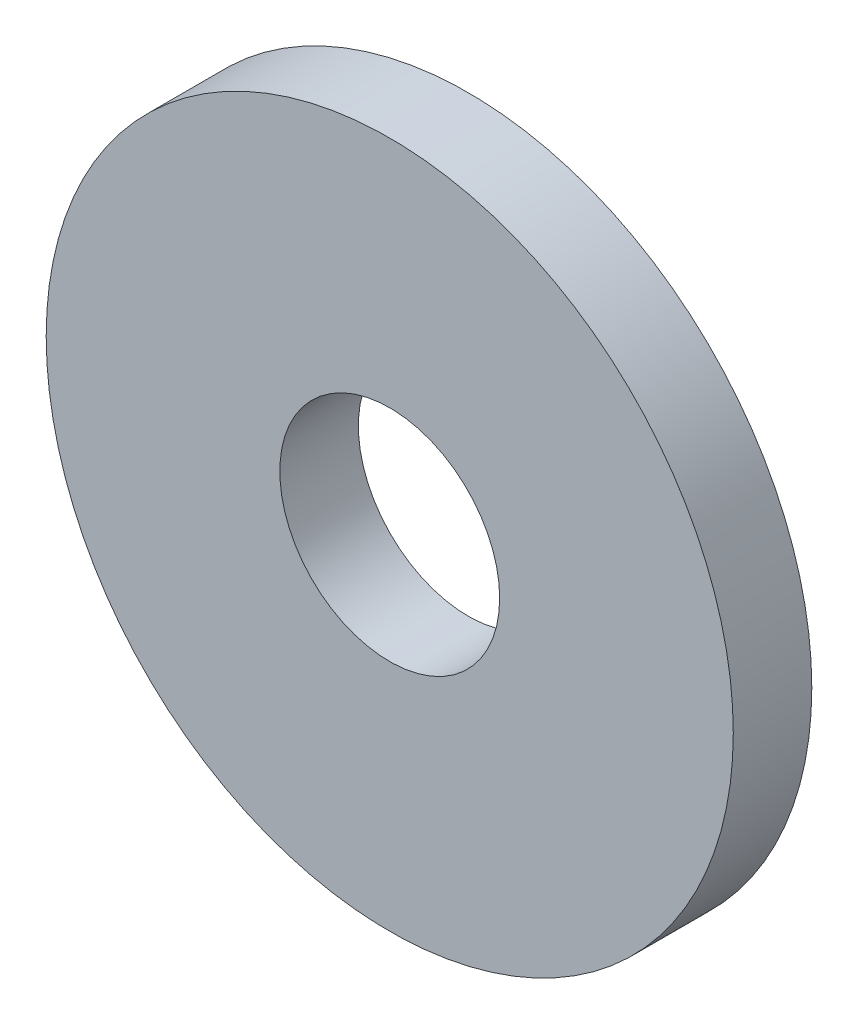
ISO-10303-21;
HEADER;
FILE_DESCRIPTION(('STEP AP214'),'2;1');
FILE_NAME('part.step','',(''),(''),'','','');
FILE_SCHEMA(('AUTOMOTIVE_DESIGN { 1 0 10303 214 1 1 1 1 }'));
ENDSEC;
DATA;
#1=APPLICATION_CONTEXT('core data for automotive mechanical design processes');
#2=APPLICATION_PROTOCOL_DEFINITION('international standard','automotive_design',2000,#1);
#3=PRODUCT_CONTEXT('',#1,'mechanical');
#4=PRODUCT('Part','Part','',(#3));
#5=PRODUCT_RELATED_PRODUCT_CATEGORY('part','',(#4));
#6=PRODUCT_DEFINITION_FORMATION('','',#4);
#7=PRODUCT_DEFINITION_CONTEXT('part definition',#1,'design');
#8=PRODUCT_DEFINITION('design','',#6,#7);
#9=PRODUCT_DEFINITION_SHAPE('','',#8);
#10=(LENGTH_UNIT() NAMED_UNIT(*) SI_UNIT(.MILLI.,.METRE.));
#11=(NAMED_UNIT(*) PLANE_ANGLE_UNIT() SI_UNIT($,.RADIAN.));
#12=(NAMED_UNIT(*) SI_UNIT($,.STERADIAN.) SOLID_ANGLE_UNIT());
#13=UNCERTAINTY_MEASURE_WITH_UNIT(LENGTH_MEASURE(1.E-05),#10,'distance_accuracy_value','');
#14=(GEOMETRIC_REPRESENTATION_CONTEXT(3) GLOBAL_UNCERTAINTY_ASSIGNED_CONTEXT((#13)) GLOBAL_UNIT_ASSIGNED_CONTEXT((#10,
#11,#12)) REPRESENTATION_CONTEXT('',''));
#15=CARTESIAN_POINT('',(0.,0.,0.));
#16=DIRECTION('',(0.,0.,1.));
#17=DIRECTION('',(1.,0.,0.));
#18=AXIS2_PLACEMENT_3D('',#15,#16,#17);
#19=CARTESIAN_POINT('',(0.,0.,2.));
#20=DIRECTION('',(0.,0.,-1.));
#21=DIRECTION('',(-1.,0.,0.));
#22=AXIS2_PLACEMENT_3D('',#19,#20,#21);
#23=PLANE('',#22);
#24=CARTESIAN_POINT('',(0.,0.,2.));
#25=DIRECTION('',(0.,0.,1.));
#26=DIRECTION('',(1.,0.,0.));
#27=AXIS2_PLACEMENT_3D('',#24,#25,#26);
#28=CIRCLE('',#27,2.8);
#29=CARTESIAN_POINT('',(2.8,0.,2.));
#30=VERTEX_POINT('',#29);
#31=EDGE_CURVE('E26',#30,#30,#28,.F.);
#32=ORIENTED_EDGE('',*,*,#31,.T.);
#33=EDGE_LOOP('',(#32));
#34=FACE_BOUND('',#33,.T.);
#35=CARTESIAN_POINT('',(0.,0.,2.));
#36=DIRECTION('',(0.,0.,1.));
#37=DIRECTION('',(1.,0.,0.));
#38=AXIS2_PLACEMENT_3D('',#35,#36,#37);
#39=CIRCLE('',#38,8.75);
#40=CARTESIAN_POINT('',(8.75,0.,2.));
#41=VERTEX_POINT('',#40);
#42=EDGE_CURVE('E17',#41,#41,#39,.F.);
#43=ORIENTED_EDGE('',*,*,#42,.F.);
#44=EDGE_LOOP('',(#43));
#45=FACE_BOUND('',#44,.T.);
#46=ADVANCED_FACE('F14',(#34,#45),#23,.F.);
#47=CARTESIAN_POINT('',(0.,0.,0.));
#48=DIRECTION('',(0.,0.,1.));
#49=DIRECTION('',(1.,0.,0.));
#50=AXIS2_PLACEMENT_3D('',#47,#48,#49);
#51=CYLINDRICAL_SURFACE('',#50,8.75);
#52=CARTESIAN_POINT('',(0.,0.,0.));
#53=DIRECTION('',(0.,0.,1.));
#54=DIRECTION('',(1.,0.,0.));
#55=AXIS2_PLACEMENT_3D('',#52,#53,#54);
#56=CIRCLE('',#55,8.75);
#57=CARTESIAN_POINT('',(8.75,0.,0.));
#58=VERTEX_POINT('',#57);
#59=EDGE_CURVE('E21',#58,#58,#56,.F.);
#60=ORIENTED_EDGE('',*,*,#59,.F.);
#61=EDGE_LOOP('',(#60));
#62=FACE_BOUND('',#61,.T.);
#63=ORIENTED_EDGE('',*,*,#42,.T.);
#64=EDGE_LOOP('',(#63));
#65=FACE_BOUND('',#64,.T.);
#66=ADVANCED_FACE('F34',(#62,#65),#51,.T.);
#67=CARTESIAN_POINT('',(0.,0.,0.));
#68=DIRECTION('',(0.,0.,1.));
#69=DIRECTION('',(1.,0.,0.));
#70=AXIS2_PLACEMENT_3D('',#67,#68,#69);
#71=CYLINDRICAL_SURFACE('',#70,2.8);
#72=CARTESIAN_POINT('',(0.,0.,0.));
#73=DIRECTION('',(0.,0.,1.));
#74=DIRECTION('',(1.,0.,0.));
#75=AXIS2_PLACEMENT_3D('',#72,#73,#74);
#76=CIRCLE('',#75,2.8);
#77=CARTESIAN_POINT('',(2.8,0.,0.));
#78=VERTEX_POINT('',#77);
#79=EDGE_CURVE('E10',#78,#78,#76,.T.);
#80=ORIENTED_EDGE('',*,*,#79,.F.);
#81=EDGE_LOOP('',(#80));
#82=FACE_BOUND('',#81,.T.);
#83=ORIENTED_EDGE('',*,*,#31,.F.);
#84=EDGE_LOOP('',(#83));
#85=FACE_BOUND('',#84,.T.);
#86=ADVANCED_FACE('F41',(#82,#85),#71,.F.);
#87=CARTESIAN_POINT('',(0.,0.,0.));
#88=DIRECTION('',(0.,0.,-1.));
#89=DIRECTION('',(-1.,0.,0.));
#90=AXIS2_PLACEMENT_3D('',#87,#88,#89);
#91=PLANE('',#90);
#92=ORIENTED_EDGE('',*,*,#79,.T.);
#93=EDGE_LOOP('',(#92));
#94=FACE_BOUND('',#93,.T.);
#95=ORIENTED_EDGE('',*,*,#59,.T.);
#96=EDGE_LOOP('',(#95));
#97=FACE_BOUND('',#96,.T.);
#98=ADVANCED_FACE('F43',(#94,#97),#91,.T.);
#99=CLOSED_SHELL('',(#46,#66,#86,#98));
#100=MANIFOLD_SOLID_BREP('B1',#99);
#101=ADVANCED_BREP_SHAPE_REPRESENTATION('',(#18,#100),#14);
#102=SHAPE_DEFINITION_REPRESENTATION(#9,#101);
ENDSEC;
END-ISO-10303-21;
